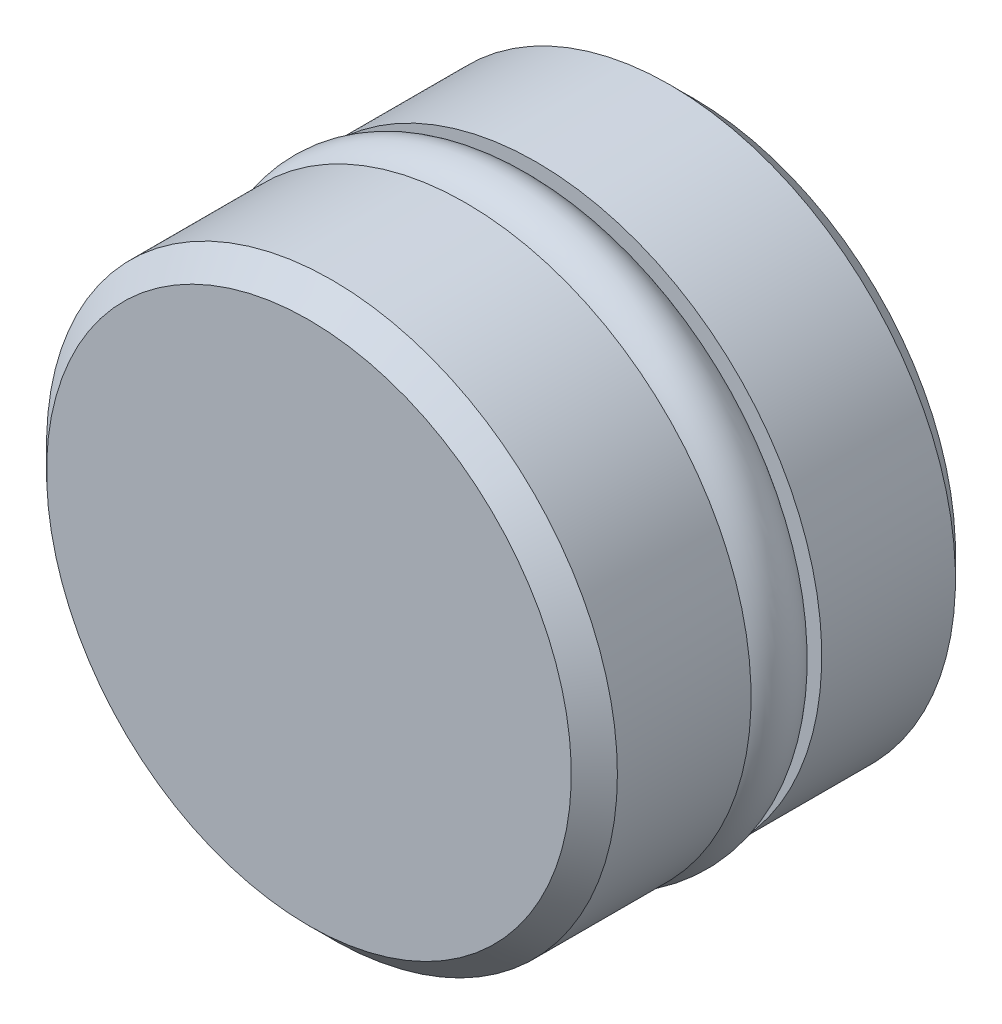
ISO-10303-21;
HEADER;
FILE_DESCRIPTION(('STEP AP214'),'2;1');
FILE_NAME('part.step','',(''),(''),'','','');
FILE_SCHEMA(('AUTOMOTIVE_DESIGN { 1 0 10303 214 1 1 1 1 }'));
ENDSEC;
DATA;
#1=APPLICATION_CONTEXT('core data for automotive mechanical design processes');
#2=APPLICATION_PROTOCOL_DEFINITION('international standard','automotive_design',2000,#1);
#3=PRODUCT_CONTEXT('',#1,'mechanical');
#4=PRODUCT('Part','Part','',(#3));
#5=PRODUCT_RELATED_PRODUCT_CATEGORY('part','',(#4));
#6=PRODUCT_DEFINITION_FORMATION('','',#4);
#7=PRODUCT_DEFINITION_CONTEXT('part definition',#1,'design');
#8=PRODUCT_DEFINITION('design','',#6,#7);
#9=PRODUCT_DEFINITION_SHAPE('','',#8);
#10=(LENGTH_UNIT() NAMED_UNIT(*) SI_UNIT(.MILLI.,.METRE.));
#11=(NAMED_UNIT(*) PLANE_ANGLE_UNIT() SI_UNIT($,.RADIAN.));
#12=(NAMED_UNIT(*) SI_UNIT($,.STERADIAN.) SOLID_ANGLE_UNIT());
#13=UNCERTAINTY_MEASURE_WITH_UNIT(LENGTH_MEASURE(1.E-05),#10,'distance_accuracy_value','');
#14=(GEOMETRIC_REPRESENTATION_CONTEXT(3) GLOBAL_UNCERTAINTY_ASSIGNED_CONTEXT((#13)) GLOBAL_UNIT_ASSIGNED_CONTEXT((#10,
#11,#12)) REPRESENTATION_CONTEXT('',''));
#15=CARTESIAN_POINT('',(0.,0.,0.));
#16=DIRECTION('',(0.,0.,1.));
#17=DIRECTION('',(1.,0.,0.));
#18=AXIS2_PLACEMENT_3D('',#15,#16,#17);
#19=CARTESIAN_POINT('',(0.,0.,6.35));
#20=DIRECTION('',(0.,0.,-1.));
#21=DIRECTION('',(-1.,0.,0.));
#22=AXIS2_PLACEMENT_3D('',#19,#20,#21);
#23=TOROIDAL_SURFACE('',#22,8.4709,1.1684);
#24=CARTESIAN_POINT('',(-9.6393,0.,6.35));
#25=VERTEX_POINT('',#24);
#26=VERTEX_LOOP('',#25);
#27=FACE_BOUND('',#26,.T.);
#28=ADVANCED_FACE('P0_F12',(#27),#23,.T.);
#29=CLOSED_SHELL('',(#28));
#30=MANIFOLD_SOLID_BREP('P0_B1',#29);
#31=CARTESIAN_POINT('',(0.,0.,6.58522979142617));
#32=DIRECTION('',(0.,0.,-1.));
#33=DIRECTION('',(0.,1.,0.));
#34=AXIS2_PLACEMENT_3D('',#31,#32,#33);
#35=CONICAL_SURFACE('',#34,2.58064000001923,1.02747003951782);
#36=CARTESIAN_POINT('',(0.,0.,6.5852297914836));
#37=DIRECTION('',(0.,0.,-1.));
#38=DIRECTION('',(0.,1.,0.));
#39=AXIS2_PLACEMENT_3D('',#36,#37,#38);
#40=CIRCLE('',#39,2.58063999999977);
#41=CARTESIAN_POINT('',(0.,2.58063999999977,6.5852297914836));
#42=VERTEX_POINT('',#41);
#43=EDGE_CURVE('P1_E77',#42,#42,#40,.T.);
#44=ORIENTED_EDGE('',*,*,#43,.T.);
#45=EDGE_LOOP('',(#44));
#46=FACE_BOUND('',#45,.T.);
#47=CARTESIAN_POINT('',(1.13686837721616E-10,0.,8.14383350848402));
#48=VERTEX_POINT('',#47);
#49=VERTEX_LOOP('',#48);
#50=FACE_BOUND('',#49,.T.);
#51=ADVANCED_FACE('P1_F15',(#46,#50),#35,.F.);
#52=CARTESIAN_POINT('',(0.,0.,3.2926148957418));
#53=DIRECTION('',(0.,0.,-1.));
#54=DIRECTION('',(0.,1.,0.));
#55=AXIS2_PLACEMENT_3D('',#52,#53,#54);
#56=CYLINDRICAL_SURFACE('',#55,2.58063999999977);
#57=ORIENTED_EDGE('',*,*,#43,.F.);
#58=EDGE_LOOP('',(#57));
#59=FACE_BOUND('',#58,.T.);
#60=CARTESIAN_POINT('',(0.,0.,0.));
#61=DIRECTION('',(0.,0.,-1.));
#62=DIRECTION('',(0.,1.,0.));
#63=AXIS2_PLACEMENT_3D('',#60,#61,#62);
#64=CIRCLE('',#63,2.58063999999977);
#65=CARTESIAN_POINT('',(0.,2.58063999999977,0.));
#66=VERTEX_POINT('',#65);
#67=EDGE_CURVE('P1_E68',#66,#66,#64,.F.);
#68=ORIENTED_EDGE('',*,*,#67,.F.);
#69=EDGE_LOOP('',(#68));
#70=FACE_BOUND('',#69,.T.);
#71=ADVANCED_FACE('P1_F27',(#59,#70),#56,.F.);
#72=CARTESIAN_POINT('',(5.62736999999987,0.,0.));
#73=DIRECTION('',(0.,0.,-1.));
#74=DIRECTION('',(-1.,0.,0.));
#75=AXIS2_PLACEMENT_3D('',#72,#73,#74);
#76=PLANE('',#75);
#77=ORIENTED_EDGE('',*,*,#67,.T.);
#78=EDGE_LOOP('',(#77));
#79=FACE_BOUND('',#78,.T.);
#80=CARTESIAN_POINT('',(0.,0.,0.));
#81=DIRECTION('',(0.,0.,1.));
#82=DIRECTION('',(0.,-1.,0.));
#83=AXIS2_PLACEMENT_3D('',#80,#81,#82);
#84=CIRCLE('',#83,8.6741);
#85=CARTESIAN_POINT('',(0.,-8.6741,0.));
#86=VERTEX_POINT('',#85);
#87=EDGE_CURVE('P1_E71',#86,#86,#84,.T.);
#88=ORIENTED_EDGE('',*,*,#87,.F.);
#89=EDGE_LOOP('',(#88));
#90=FACE_BOUND('',#89,.T.);
#91=ADVANCED_FACE('P1_F34',(#79,#90),#76,.T.);
#92=CARTESIAN_POINT('',(0.,0.,0.762));
#93=DIRECTION('',(0.,0.,1.));
#94=DIRECTION('',(0.,-1.,0.));
#95=AXIS2_PLACEMENT_3D('',#92,#93,#94);
#96=CONICAL_SURFACE('',#95,9.4361,0.785398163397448);
#97=ORIENTED_EDGE('',*,*,#87,.T.);
#98=EDGE_LOOP('',(#97));
#99=FACE_BOUND('',#98,.T.);
#100=CARTESIAN_POINT('',(0.,0.,0.762));
#101=DIRECTION('',(0.,0.,-1.));
#102=DIRECTION('',(0.,1.,0.));
#103=AXIS2_PLACEMENT_3D('',#100,#101,#102);
#104=CIRCLE('',#103,9.4361);
#105=CARTESIAN_POINT('',(0.,9.4361,0.761999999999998));
#106=VERTEX_POINT('',#105);
#107=EDGE_CURVE('P1_E72',#106,#106,#104,.F.);
#108=ORIENTED_EDGE('',*,*,#107,.F.);
#109=EDGE_LOOP('',(#108));
#110=FACE_BOUND('',#109,.T.);
#111=ADVANCED_FACE('P1_F49',(#99,#110),#96,.T.);
#112=CARTESIAN_POINT('',(0.,0.,2.9591));
#113=DIRECTION('',(0.,0.,-1.));
#114=DIRECTION('',(0.,1.,0.));
#115=AXIS2_PLACEMENT_3D('',#112,#113,#114);
#116=CYLINDRICAL_SURFACE('',#115,9.4361);
#117=ORIENTED_EDGE('',*,*,#107,.T.);
#118=EDGE_LOOP('',(#117));
#119=FACE_BOUND('',#118,.T.);
#120=CARTESIAN_POINT('',(0.,0.,5.1816));
#121=DIRECTION('',(0.,0.,-1.));
#122=DIRECTION('',(0.,1.,0.));
#123=AXIS2_PLACEMENT_3D('',#120,#121,#122);
#124=CIRCLE('',#123,9.4361);
#125=CARTESIAN_POINT('',(0.,9.4361,5.1816));
#126=VERTEX_POINT('',#125);
#127=EDGE_CURVE('P1_E75',#126,#126,#124,.F.);
#128=ORIENTED_EDGE('',*,*,#127,.F.);
#129=EDGE_LOOP('',(#128));
#130=FACE_BOUND('',#129,.T.);
#131=ADVANCED_FACE('P1_F43',(#119,#130),#116,.T.);
#132=CARTESIAN_POINT('',(8.36295,0.,5.1816));
#133=DIRECTION('',(0.,0.,1.));
#134=DIRECTION('',(1.,0.,0.));
#135=AXIS2_PLACEMENT_3D('',#132,#133,#134);
#136=PLANE('',#135);
#137=ORIENTED_EDGE('',*,*,#127,.T.);
#138=EDGE_LOOP('',(#137));
#139=FACE_BOUND('',#138,.T.);
#140=CARTESIAN_POINT('',(0.,0.,5.1816));
#141=DIRECTION('',(0.,0.,-1.));
#142=DIRECTION('',(-1.,0.,0.));
#143=AXIS2_PLACEMENT_3D('',#140,#141,#142);
#144=CIRCLE('',#143,7.3025);
#145=CARTESIAN_POINT('',(-7.3025,0.,5.1816));
#146=VERTEX_POINT('',#145);
#147=EDGE_CURVE('P1_E81',#146,#146,#144,.T.);
#148=ORIENTED_EDGE('',*,*,#147,.T.);
#149=EDGE_LOOP('',(#148));
#150=FACE_BOUND('',#149,.T.);
#151=ADVANCED_FACE('P1_F39',(#139,#150),#136,.T.);
#152=CARTESIAN_POINT('',(0.,0.,0.));
#153=DIRECTION('',(0.,0.,-1.));
#154=DIRECTION('',(-1.,0.,0.));
#155=AXIS2_PLACEMENT_3D('',#152,#153,#154);
#156=CYLINDRICAL_SURFACE('',#155,7.3025);
#157=ORIENTED_EDGE('',*,*,#147,.F.);
#158=EDGE_LOOP('',(#157));
#159=FACE_BOUND('',#158,.T.);
#160=CARTESIAN_POINT('',(0.,0.,7.5184));
#161=DIRECTION('',(0.,0.,-1.));
#162=DIRECTION('',(-1.,0.,0.));
#163=AXIS2_PLACEMENT_3D('',#160,#161,#162);
#164=CIRCLE('',#163,7.3025);
#165=CARTESIAN_POINT('',(-7.3025,0.,7.5184));
#166=VERTEX_POINT('',#165);
#167=EDGE_CURVE('P1_E18',#166,#166,#164,.F.);
#168=ORIENTED_EDGE('',*,*,#167,.F.);
#169=EDGE_LOOP('',(#168));
#170=FACE_BOUND('',#169,.T.);
#171=ADVANCED_FACE('P1_F29',(#159,#170),#156,.T.);
#172=CARTESIAN_POINT('',(4.33705,0.,12.7));
#173=DIRECTION('',(0.,0.,1.));
#174=DIRECTION('',(1.,0.,0.));
#175=AXIS2_PLACEMENT_3D('',#172,#173,#174);
#176=PLANE('',#175);
#177=CARTESIAN_POINT('',(0.,0.,12.7));
#178=DIRECTION('',(0.,0.,-1.));
#179=DIRECTION('',(0.,1.,0.));
#180=AXIS2_PLACEMENT_3D('',#177,#178,#179);
#181=CIRCLE('',#180,8.6741);
#182=CARTESIAN_POINT('',(0.,8.6741,12.7));
#183=VERTEX_POINT('',#182);
#184=EDGE_CURVE('P1_E10',#183,#183,#181,.F.);
#185=ORIENTED_EDGE('',*,*,#184,.T.);
#186=EDGE_LOOP('',(#185));
#187=FACE_BOUND('',#186,.T.);
#188=ADVANCED_FACE('P1_F38',(#187),#176,.T.);
#189=CARTESIAN_POINT('',(0.,0.,11.938));
#190=DIRECTION('',(0.,0.,-1.));
#191=DIRECTION('',(0.,1.,0.));
#192=AXIS2_PLACEMENT_3D('',#189,#190,#191);
#193=CONICAL_SURFACE('',#192,9.4361,0.785398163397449);
#194=CARTESIAN_POINT('',(0.,0.,11.938));
#195=DIRECTION('',(0.,0.,-1.));
#196=DIRECTION('',(1.,0.,0.));
#197=AXIS2_PLACEMENT_3D('',#194,#195,#196);
#198=CIRCLE('',#197,9.4361);
#199=CARTESIAN_POINT('',(9.4361,0.,11.938));
#200=VERTEX_POINT('',#199);
#201=EDGE_CURVE('P1_E22',#200,#200,#198,.F.);
#202=ORIENTED_EDGE('',*,*,#201,.T.);
#203=EDGE_LOOP('',(#202));
#204=FACE_BOUND('',#203,.T.);
#205=ORIENTED_EDGE('',*,*,#184,.F.);
#206=EDGE_LOOP('',(#205));
#207=FACE_BOUND('',#206,.T.);
#208=ADVANCED_FACE('P1_F95',(#204,#207),#193,.T.);
#209=CARTESIAN_POINT('',(0.,0.,9.7409));
#210=DIRECTION('',(0.,0.,-1.));
#211=DIRECTION('',(0.,1.,0.));
#212=AXIS2_PLACEMENT_3D('',#209,#210,#211);
#213=CYLINDRICAL_SURFACE('',#212,9.4361);
#214=CARTESIAN_POINT('',(0.,0.,7.5184));
#215=DIRECTION('',(0.,0.,-1.));
#216=DIRECTION('',(0.,1.,0.));
#217=AXIS2_PLACEMENT_3D('',#214,#215,#216);
#218=CIRCLE('',#217,9.4361);
#219=CARTESIAN_POINT('',(0.,9.4361,7.5184));
#220=VERTEX_POINT('',#219);
#221=EDGE_CURVE('P1_E99',#220,#220,#218,.F.);
#222=ORIENTED_EDGE('',*,*,#221,.T.);
#223=EDGE_LOOP('',(#222));
#224=FACE_BOUND('',#223,.T.);
#225=ORIENTED_EDGE('',*,*,#201,.F.);
#226=EDGE_LOOP('',(#225));
#227=FACE_BOUND('',#226,.T.);
#228=ADVANCED_FACE('P1_F90',(#224,#227),#213,.T.);
#229=CARTESIAN_POINT('',(8.36295,0.,7.5184));
#230=DIRECTION('',(0.,0.,-1.));
#231=DIRECTION('',(-1.,0.,0.));
#232=AXIS2_PLACEMENT_3D('',#229,#230,#231);
#233=PLANE('',#232);
#234=ORIENTED_EDGE('',*,*,#221,.F.);
#235=EDGE_LOOP('',(#234));
#236=FACE_BOUND('',#235,.T.);
#237=ORIENTED_EDGE('',*,*,#167,.T.);
#238=EDGE_LOOP('',(#237));
#239=FACE_BOUND('',#238,.T.);
#240=ADVANCED_FACE('P1_F55',(#236,#239),#233,.T.);
#241=CLOSED_SHELL('',(#51,#71,#91,#111,#131,#151,#171,#188,#208,#228,#240));
#242=MANIFOLD_SOLID_BREP('P1_B1',#241);
#243=ADVANCED_BREP_SHAPE_REPRESENTATION('',(#18,#30,#242),#14);
#244=SHAPE_DEFINITION_REPRESENTATION(#9,#243);
ENDSEC;
END-ISO-10303-21;
